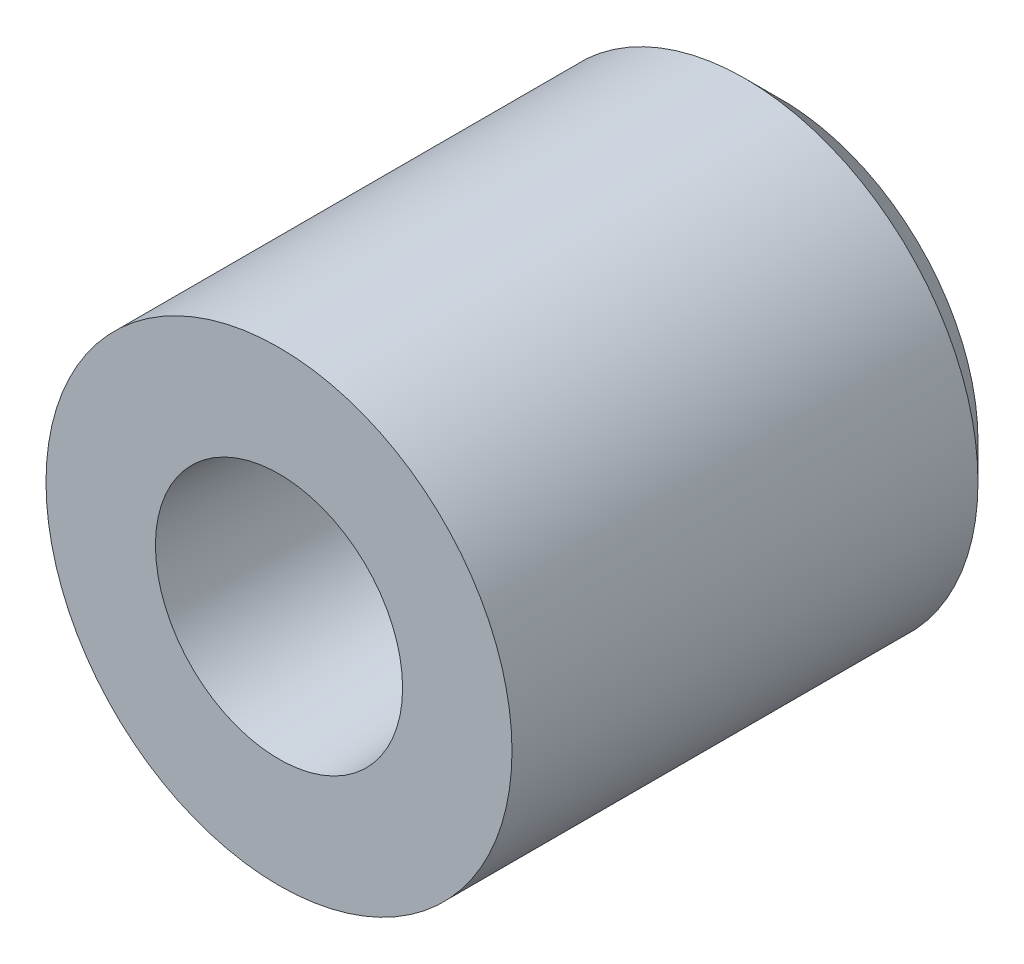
ISO-10303-21;
HEADER;
FILE_DESCRIPTION(('STEP AP214'),'2;1');
FILE_NAME('part.step','',(''),(''),'','','');
FILE_SCHEMA(('AUTOMOTIVE_DESIGN { 1 0 10303 214 1 1 1 1 }'));
ENDSEC;
DATA;
#1=APPLICATION_CONTEXT('core data for automotive mechanical design processes');
#2=APPLICATION_PROTOCOL_DEFINITION('international standard','automotive_design',2000,#1);
#3=PRODUCT_CONTEXT('',#1,'mechanical');
#4=PRODUCT('Part','Part','',(#3));
#5=PRODUCT_RELATED_PRODUCT_CATEGORY('part','',(#4));
#6=PRODUCT_DEFINITION_FORMATION('','',#4);
#7=PRODUCT_DEFINITION_CONTEXT('part definition',#1,'design');
#8=PRODUCT_DEFINITION('design','',#6,#7);
#9=PRODUCT_DEFINITION_SHAPE('','',#8);
#10=(LENGTH_UNIT() NAMED_UNIT(*) SI_UNIT(.MILLI.,.METRE.));
#11=(NAMED_UNIT(*) PLANE_ANGLE_UNIT() SI_UNIT($,.RADIAN.));
#12=(NAMED_UNIT(*) SI_UNIT($,.STERADIAN.) SOLID_ANGLE_UNIT());
#13=UNCERTAINTY_MEASURE_WITH_UNIT(LENGTH_MEASURE(1.E-05),#10,'distance_accuracy_value','');
#14=(GEOMETRIC_REPRESENTATION_CONTEXT(3) GLOBAL_UNCERTAINTY_ASSIGNED_CONTEXT((#13)) GLOBAL_UNIT_ASSIGNED_CONTEXT((#10,
#11,#12)) REPRESENTATION_CONTEXT('',''));
#15=CARTESIAN_POINT('',(0.,0.,0.));
#16=DIRECTION('',(0.,0.,1.));
#17=DIRECTION('',(1.,0.,0.));
#18=AXIS2_PLACEMENT_3D('',#15,#16,#17);
#19=CARTESIAN_POINT('',(0.,0.,-6.68050060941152));
#20=DIRECTION('',(0.,0.,1.));
#21=DIRECTION('',(1.,0.,0.));
#22=AXIS2_PLACEMENT_3D('',#19,#20,#21);
#23=CONICAL_SURFACE('',#22,4.50505271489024,0.785398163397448);
#24=CARTESIAN_POINT('',(0.,0.,-9.));
#25=DIRECTION('',(0.,0.,1.));
#26=DIRECTION('',(-1.,0.,0.));
#27=AXIS2_PLACEMENT_3D('',#24,#25,#26);
#28=CIRCLE('',#27,2.18555332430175);
#29=CARTESIAN_POINT('',(2.18555332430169,0.,-9.));
#30=VERTEX_POINT('',#29);
#31=CARTESIAN_POINT('',(-2.18555332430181,0.,-9.));
#32=VERTEX_POINT('',#31);
#33=EDGE_CURVE('E143',#30,#32,#28,.T.);
#34=ORIENTED_EDGE('',*,*,#33,.F.);
#35=CARTESIAN_POINT('',(2.18555194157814,0.,-9.00000138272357));
#36=CARTESIAN_POINT('',(3.18555409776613,0.,-7.99999922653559));
#37=B_SPLINE_CURVE_WITH_KNOTS('',1,(#35,#36),.UNSPECIFIED.,.F.,.F.,(2,2),(0.48513348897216,
0.707106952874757),.UNSPECIFIED.);
#38=CARTESIAN_POINT('',(3.18555332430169,0.,-8.));
#39=VERTEX_POINT('',#38);
#40=EDGE_CURVE('E44',#30,#39,#37,.T.);
#41=ORIENTED_EDGE('',*,*,#40,.T.);
#42=CARTESIAN_POINT('',(0.,0.,-8.));
#43=DIRECTION('',(0.,0.,-1.));
#44=DIRECTION('',(-1.,0.,0.));
#45=AXIS2_PLACEMENT_3D('',#42,#43,#44);
#46=CIRCLE('',#45,3.18555332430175);
#47=CARTESIAN_POINT('',(-3.18555332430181,0.,-8.));
#48=VERTEX_POINT('',#47);
#49=EDGE_CURVE('E11',#48,#39,#46,.T.);
#50=ORIENTED_EDGE('',*,*,#49,.F.);
#51=CARTESIAN_POINT('',(0.,0.,-8.));
#52=DIRECTION('',(0.,0.,-1.));
#53=DIRECTION('',(-1.,0.,0.));
#54=AXIS2_PLACEMENT_3D('',#51,#52,#53);
#55=CIRCLE('',#54,3.18555332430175);
#56=EDGE_CURVE('E51',#39,#48,#55,.T.);
#57=ORIENTED_EDGE('',*,*,#56,.F.);
#58=ORIENTED_EDGE('',*,*,#40,.F.);
#59=CARTESIAN_POINT('',(0.,0.,-9.));
#60=DIRECTION('',(0.,0.,1.));
#61=DIRECTION('',(-1.,0.,0.));
#62=AXIS2_PLACEMENT_3D('',#59,#60,#61);
#63=CIRCLE('',#62,2.18555332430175);
#64=EDGE_CURVE('E59',#32,#30,#63,.T.);
#65=ORIENTED_EDGE('',*,*,#64,.F.);
#66=EDGE_LOOP('',(#34,#41,#50,#57,#58,#65));
#67=FACE_BOUND('',#66,.T.);
#68=ADVANCED_FACE('F36',(#67),#23,.F.);
#69=CARTESIAN_POINT('',(0.,0.,-7.5));
#70=DIRECTION('',(0.,0.,-1.));
#71=DIRECTION('',(-1.,0.,0.));
#72=AXIS2_PLACEMENT_3D('',#69,#70,#71);
#73=CYLINDRICAL_SURFACE('',#72,3.18555332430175);
#74=CARTESIAN_POINT('',(0.,0.,-6.));
#75=DIRECTION('',(0.,0.,-1.));
#76=DIRECTION('',(-1.,0.,0.));
#77=AXIS2_PLACEMENT_3D('',#74,#75,#76);
#78=CIRCLE('',#77,3.18555332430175);
#79=CARTESIAN_POINT('',(-3.18555332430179,0.,-6.));
#80=VERTEX_POINT('',#79);
#81=EDGE_CURVE('E152',#80,#80,#78,.T.);
#82=ORIENTED_EDGE('',*,*,#81,.F.);
#83=CARTESIAN_POINT('',(-3.18555332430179,0.,-5.99999694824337));
#84=CARTESIAN_POINT('',(-3.18555332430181,0.,-8.000002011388));
#85=B_SPLINE_CURVE_WITH_KNOTS('',1,(#83,#84),.UNSPECIFIED.,.F.,.F.,(2,2),(0.0833320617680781,
0.91666750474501),.UNSPECIFIED.);
#86=EDGE_CURVE('E147',#80,#48,#85,.T.);
#87=ORIENTED_EDGE('',*,*,#86,.T.);
#88=ORIENTED_EDGE('',*,*,#49,.T.);
#89=ORIENTED_EDGE('',*,*,#56,.T.);
#90=ORIENTED_EDGE('',*,*,#86,.F.);
#91=EDGE_LOOP('',(#82,#87,#88,#89,#90));
#92=FACE_BOUND('',#91,.T.);
#93=ADVANCED_FACE('F191',(#92),#73,.F.);
#94=CARTESIAN_POINT('',(5.02677264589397,-4.54258728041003,-9.));
#95=DIRECTION('',(0.,0.,-1.));
#96=DIRECTION('',(-1.,0.,0.));
#97=AXIS2_PLACEMENT_3D('',#94,#95,#96);
#98=PLANE('',#97);
#99=CARTESIAN_POINT('',(-1.04744440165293E-13,0.,-8.99999999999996));
#100=DIRECTION('',(0.,0.,-1.));
#101=DIRECTION('',(-1.,0.,0.));
#102=AXIS2_PLACEMENT_3D('',#99,#100,#101);
#103=CIRCLE('',#102,1.64999999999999);
#104=CARTESIAN_POINT('',(-1.6500000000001,0.,-8.99999999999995));
#105=VERTEX_POINT('',#104);
#106=EDGE_CURVE('E103',#105,#105,#103,.T.);
#107=ORIENTED_EDGE('',*,*,#106,.T.);
#108=EDGE_LOOP('',(#107));
#109=FACE_BOUND('',#108,.T.);
#110=ORIENTED_EDGE('',*,*,#64,.T.);
#111=ORIENTED_EDGE('',*,*,#33,.T.);
#112=EDGE_LOOP('',(#110,#111));
#113=FACE_BOUND('',#112,.T.);
#114=ADVANCED_FACE('F193',(#109,#113),#98,.F.);
#115=CARTESIAN_POINT('',(0.,0.,-1.));
#116=DIRECTION('',(0.,0.,1.));
#117=DIRECTION('',(-1.,0.,0.));
#118=AXIS2_PLACEMENT_3D('',#115,#116,#117);
#119=CONICAL_SURFACE('',#118,3.44759222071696,0.0523598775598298);
#120=ORIENTED_EDGE('',*,*,#81,.T.);
#121=CARTESIAN_POINT('',(-3.18555332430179,0.,-6.));
#122=CARTESIAN_POINT('',(-3.44759222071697,0.,-0.999999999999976));
#123=B_SPLINE_CURVE_WITH_KNOTS('',1,(#121,#122),.UNSPECIFIED.,.F.,.F.,(2,2),(0.,1.),.UNSPECIFIED.);
#124=CARTESIAN_POINT('',(-3.44759222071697,0.,-0.999999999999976));
#125=VERTEX_POINT('',#124);
#126=EDGE_CURVE('E108',#80,#125,#123,.T.);
#127=ORIENTED_EDGE('',*,*,#126,.T.);
#128=CARTESIAN_POINT('',(0.,0.,-1.));
#129=DIRECTION('',(0.,0.,-1.));
#130=DIRECTION('',(1.,0.,0.));
#131=AXIS2_PLACEMENT_3D('',#128,#129,#130);
#132=CIRCLE('',#131,3.44759222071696);
#133=CARTESIAN_POINT('',(3.44759222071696,0.,-1.00000000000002));
#134=VERTEX_POINT('',#133);
#135=EDGE_CURVE('E133',#134,#125,#132,.T.);
#136=ORIENTED_EDGE('',*,*,#135,.F.);
#137=CARTESIAN_POINT('',(0.,0.,-1.));
#138=DIRECTION('',(0.,0.,-1.));
#139=DIRECTION('',(1.,0.,0.));
#140=AXIS2_PLACEMENT_3D('',#137,#138,#139);
#141=CIRCLE('',#140,3.44759222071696);
#142=EDGE_CURVE('E126',#125,#134,#141,.T.);
#143=ORIENTED_EDGE('',*,*,#142,.F.);
#144=ORIENTED_EDGE('',*,*,#126,.F.);
#145=EDGE_LOOP('',(#120,#127,#136,#143,#144));
#146=FACE_BOUND('',#145,.T.);
#147=ADVANCED_FACE('F189',(#146),#119,.F.);
#148=CARTESIAN_POINT('',(0.,0.,-11.3076118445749));
#149=DIRECTION('',(0.,0.,1.));
#150=DIRECTION('',(1.,0.,0.));
#151=AXIS2_PLACEMENT_3D('',#148,#149,#150);
#152=CONICAL_SURFACE('',#151,9.19238815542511,0.785398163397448);
#153=CARTESIAN_POINT('',(-1.04744440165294E-13,0.,-15.));
#154=DIRECTION('',(0.,0.,1.));
#155=DIRECTION('',(-1.,0.,0.));
#156=AXIS2_PLACEMENT_3D('',#153,#154,#155);
#157=CIRCLE('',#156,5.5);
#158=CARTESIAN_POINT('',(-5.50000000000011,0.,-15.));
#159=VERTEX_POINT('',#158);
#160=CARTESIAN_POINT('',(5.4999999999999,0.,-15.));
#161=VERTEX_POINT('',#160);
#162=EDGE_CURVE('E90',#159,#161,#157,.T.);
#163=ORIENTED_EDGE('',*,*,#162,.T.);
#164=CARTESIAN_POINT('',(5.50000026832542,0.,-14.9999997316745));
#165=CARTESIAN_POINT('',(6.50000039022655,0.,-13.9999996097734));
#166=B_SPLINE_CURVE_WITH_KNOTS('',1,(#164,#165),.UNSPECIFIED.,.F.,.F.,(2,2),(0.598321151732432,
0.707106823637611),.UNSPECIFIED.);
#167=CARTESIAN_POINT('',(6.4999999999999,0.,-14.));
#168=VERTEX_POINT('',#167);
#169=EDGE_CURVE('E95',#161,#168,#166,.T.);
#170=ORIENTED_EDGE('',*,*,#169,.T.);
#171=CARTESIAN_POINT('',(0.,0.,-14.));
#172=DIRECTION('',(0.,0.,-1.));
#173=DIRECTION('',(-1.,0.,0.));
#174=AXIS2_PLACEMENT_3D('',#171,#172,#173);
#175=CIRCLE('',#174,6.5);
#176=CARTESIAN_POINT('',(-6.5000000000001,0.,-14.));
#177=VERTEX_POINT('',#176);
#178=EDGE_CURVE('E102',#168,#177,#175,.T.);
#179=ORIENTED_EDGE('',*,*,#178,.T.);
#180=CARTESIAN_POINT('',(0.,0.,-14.));
#181=DIRECTION('',(0.,0.,-1.));
#182=DIRECTION('',(-1.,0.,0.));
#183=AXIS2_PLACEMENT_3D('',#180,#181,#182);
#184=CIRCLE('',#183,6.5);
#185=EDGE_CURVE('E105',#177,#168,#184,.T.);
#186=ORIENTED_EDGE('',*,*,#185,.T.);
#187=ORIENTED_EDGE('',*,*,#169,.F.);
#188=CARTESIAN_POINT('',(-1.04744440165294E-13,0.,-15.));
#189=DIRECTION('',(0.,0.,1.));
#190=DIRECTION('',(-1.,0.,0.));
#191=AXIS2_PLACEMENT_3D('',#188,#189,#190);
#192=CIRCLE('',#191,5.5);
#193=EDGE_CURVE('E97',#161,#159,#192,.T.);
#194=ORIENTED_EDGE('',*,*,#193,.T.);
#195=EDGE_LOOP('',(#163,#170,#179,#186,#187,#194));
#196=FACE_BOUND('',#195,.T.);
#197=ADVANCED_FACE('F92',(#196),#152,.T.);
#198=CARTESIAN_POINT('',(0.,0.,-8.));
#199=DIRECTION('',(0.,0.,-1.));
#200=DIRECTION('',(-1.,0.,0.));
#201=AXIS2_PLACEMENT_3D('',#198,#199,#200);
#202=CYLINDRICAL_SURFACE('',#201,6.5);
#203=CARTESIAN_POINT('',(0.,0.,-1.));
#204=DIRECTION('',(0.,0.,1.));
#205=DIRECTION('',(-1.,0.,0.));
#206=AXIS2_PLACEMENT_3D('',#203,#204,#205);
#207=CIRCLE('',#206,6.5);
#208=CARTESIAN_POINT('',(-6.5,0.,-0.999999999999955));
#209=VERTEX_POINT('',#208);
#210=EDGE_CURVE('E99',#209,#209,#207,.T.);
#211=ORIENTED_EDGE('',*,*,#210,.F.);
#212=CARTESIAN_POINT('',(-6.5,0.,-1.00000099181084));
#213=CARTESIAN_POINT('',(-6.5000000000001,0.,-14.0000013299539));
#214=B_SPLINE_CURVE_WITH_KNOTS('',1,(#212,#213),.UNSPECIFIED.,.F.,.F.,(2,2),(0.0833333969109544,
0.916666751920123),.UNSPECIFIED.);
#215=EDGE_CURVE('E173',#209,#177,#214,.T.);
#216=ORIENTED_EDGE('',*,*,#215,.T.);
#217=ORIENTED_EDGE('',*,*,#178,.F.);
#218=ORIENTED_EDGE('',*,*,#185,.F.);
#219=ORIENTED_EDGE('',*,*,#215,.F.);
#220=EDGE_LOOP('',(#211,#216,#217,#218,#219));
#221=FACE_BOUND('',#220,.T.);
#222=ADVANCED_FACE('F225',(#221),#202,.T.);
#223=CARTESIAN_POINT('',(12.65,-11.4315353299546,-15.));
#224=DIRECTION('',(0.,0.,-1.));
#225=DIRECTION('',(-1.,0.,0.));
#226=AXIS2_PLACEMENT_3D('',#223,#224,#225);
#227=PLANE('',#226);
#228=CARTESIAN_POINT('',(-1.04744440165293E-13,0.,-14.9999999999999));
#229=DIRECTION('',(0.,0.,-1.));
#230=DIRECTION('',(-1.,0.,0.));
#231=AXIS2_PLACEMENT_3D('',#228,#229,#230);
#232=CIRCLE('',#231,1.64999999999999);
#233=CARTESIAN_POINT('',(-1.65000000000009,0.,-14.9999999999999));
#234=VERTEX_POINT('',#233);
#235=EDGE_CURVE('E275',#234,#234,#232,.T.);
#236=ORIENTED_EDGE('',*,*,#235,.F.);
#237=EDGE_LOOP('',(#236));
#238=FACE_BOUND('',#237,.T.);
#239=ORIENTED_EDGE('',*,*,#193,.F.);
#240=ORIENTED_EDGE('',*,*,#162,.F.);
#241=EDGE_LOOP('',(#239,#240));
#242=FACE_BOUND('',#241,.T.);
#243=ADVANCED_FACE('F101',(#238,#242),#227,.T.);
#244=CARTESIAN_POINT('',(-8.45,-13.5099962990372,-0.999999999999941));
#245=DIRECTION('',(0.,0.,1.));
#246=DIRECTION('',(1.,0.,0.));
#247=AXIS2_PLACEMENT_3D('',#244,#245,#246);
#248=PLANE('',#247);
#249=ORIENTED_EDGE('',*,*,#210,.T.);
#250=EDGE_LOOP('',(#249));
#251=FACE_BOUND('',#250,.T.);
#252=ORIENTED_EDGE('',*,*,#135,.T.);
#253=ORIENTED_EDGE('',*,*,#142,.T.);
#254=EDGE_LOOP('',(#252,#253));
#255=FACE_BOUND('',#254,.T.);
#256=ADVANCED_FACE('F240',(#251,#255),#248,.T.);
#257=CARTESIAN_POINT('',(-1.04744440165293E-13,0.,-14.9999999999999));
#258=DIRECTION('',(0.,0.,-1.));
#259=DIRECTION('',(-1.,0.,0.));
#260=AXIS2_PLACEMENT_3D('',#257,#258,#259);
#261=CYLINDRICAL_SURFACE('',#260,1.64999999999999);
#262=ORIENTED_EDGE('',*,*,#235,.T.);
#263=EDGE_LOOP('',(#262));
#264=FACE_BOUND('',#263,.T.);
#265=ORIENTED_EDGE('',*,*,#106,.F.);
#266=EDGE_LOOP('',(#265));
#267=FACE_BOUND('',#266,.T.);
#268=ADVANCED_FACE('F248',(#264,#267),#261,.F.);
#269=CLOSED_SHELL('',(#68,#93,#114,#147,#197,#222,#243,#256,#268));
#270=MANIFOLD_SOLID_BREP('B2',#269);
#271=ADVANCED_BREP_SHAPE_REPRESENTATION('',(#18,#270),#14);
#272=SHAPE_DEFINITION_REPRESENTATION(#9,#271);
ENDSEC;
END-ISO-10303-21;
